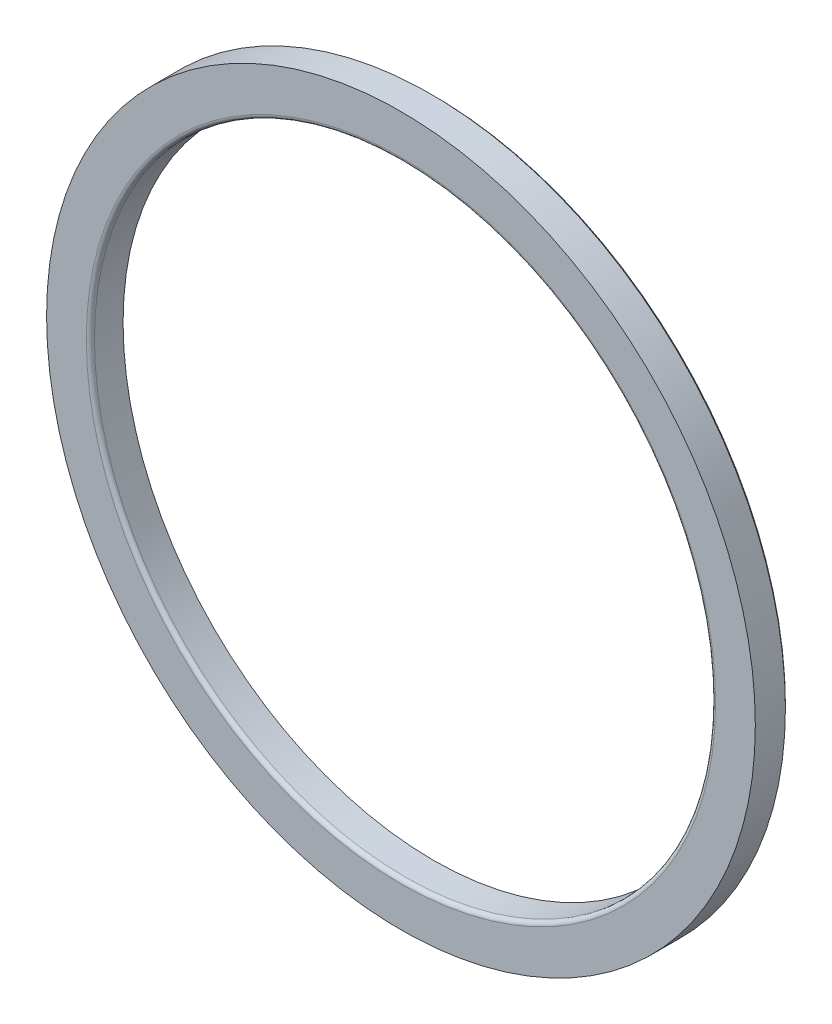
from build123d import *

# Parameters (mm, degrees)
SKETCH1_R           = 68.834
SKETCH1_R_2         = 60.325
BOSS_EXTRUDE1_DEPTH = 6.35
CHAMFER1_SIZE       = 0.508
FILLET1_R           = 0.79375


with BuildPart() as part:
    # Sketch1 → Boss-Extrude1 (new body)
    with BuildSketch(Plane.XY):
        Circle(SKETCH1_R)
        Circle(SKETCH1_R_2, mode=Mode.SUBTRACT)
    extrude(amount=BOSS_EXTRUDE1_DEPTH)

    # Chamfer1
    chamfer1_edges = [part.edges().sort_by_distance(p)[0] for p in [
        (-68.834, 0, 0),
    ]]
    chamfer(chamfer1_edges, length=CHAMFER1_SIZE)

    # Fillet1
    fillet1_edges = [part.edges().sort_by_distance(p)[0] for p in [
        (-60.325, 0, 6.35),
    ]]
    fillet(fillet1_edges, radius=FILLET1_R)


solid = part.part
